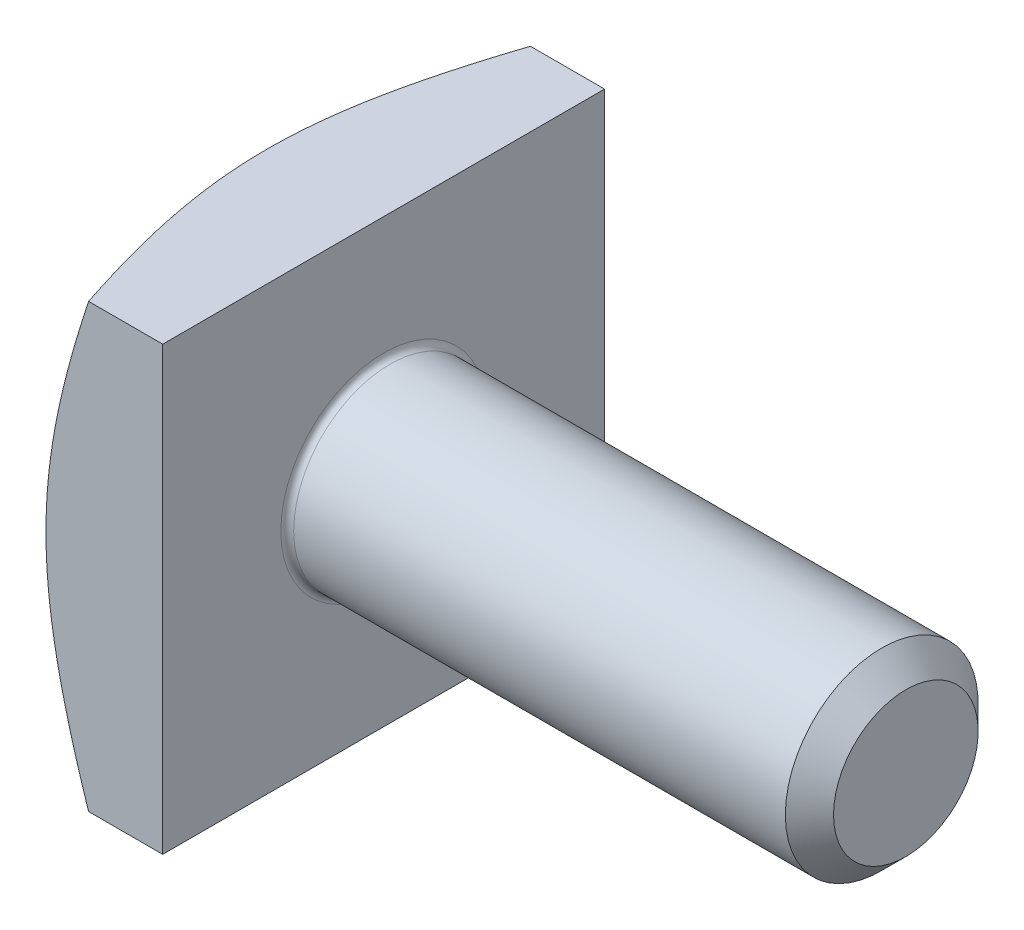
ISO-10303-21;
HEADER;
FILE_DESCRIPTION(('STEP AP214'),'2;1');
FILE_NAME('part.step','',(''),(''),'','','');
FILE_SCHEMA(('AUTOMOTIVE_DESIGN { 1 0 10303 214 1 1 1 1 }'));
ENDSEC;
DATA;
#1=APPLICATION_CONTEXT('core data for automotive mechanical design processes');
#2=APPLICATION_PROTOCOL_DEFINITION('international standard','automotive_design',2000,#1);
#3=PRODUCT_CONTEXT('',#1,'mechanical');
#4=PRODUCT('Part','Part','',(#3));
#5=PRODUCT_RELATED_PRODUCT_CATEGORY('part','',(#4));
#6=PRODUCT_DEFINITION_FORMATION('','',#4);
#7=PRODUCT_DEFINITION_CONTEXT('part definition',#1,'design');
#8=PRODUCT_DEFINITION('design','',#6,#7);
#9=PRODUCT_DEFINITION_SHAPE('','',#8);
#10=(LENGTH_UNIT() NAMED_UNIT(*) SI_UNIT(.MILLI.,.METRE.));
#11=(NAMED_UNIT(*) PLANE_ANGLE_UNIT() SI_UNIT($,.RADIAN.));
#12=(NAMED_UNIT(*) SI_UNIT($,.STERADIAN.) SOLID_ANGLE_UNIT());
#13=UNCERTAINTY_MEASURE_WITH_UNIT(LENGTH_MEASURE(1.E-05),#10,'distance_accuracy_value','');
#14=(GEOMETRIC_REPRESENTATION_CONTEXT(3) GLOBAL_UNCERTAINTY_ASSIGNED_CONTEXT((#13)) GLOBAL_UNIT_ASSIGNED_CONTEXT((#10,
#11,#12)) REPRESENTATION_CONTEXT('',''));
#15=CARTESIAN_POINT('',(0.,0.,0.));
#16=DIRECTION('',(0.,0.,1.));
#17=DIRECTION('',(1.,0.,0.));
#18=AXIS2_PLACEMENT_3D('',#15,#16,#17);
#19=CARTESIAN_POINT('',(15.,-27.5,-27.5));
#20=DIRECTION('',(0.,0.,1.));
#21=DIRECTION('',(1.,0.,0.));
#22=AXIS2_PLACEMENT_3D('',#19,#20,#21);
#23=PLANE('',#22);
#24=CARTESIAN_POINT('',(16.7818884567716,-56.11247290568,-27.5));
#25=CARTESIAN_POINT('',(16.4875123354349,-55.4094358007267,-27.5));
#26=CARTESIAN_POINT('',(16.1940417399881,-54.7060196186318,-27.5));
#27=CARTESIAN_POINT('',(15.6091098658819,-53.2983501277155,-27.5));
#28=CARTESIAN_POINT('',(15.3176485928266,-52.5940968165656,-27.5));
#29=CARTESIAN_POINT('',(14.4465554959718,-50.479912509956,-27.5));
#30=CARTESIAN_POINT('',(13.8702378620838,-49.0686130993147,-27.5));
#31=CARTESIAN_POINT('',(12.7280461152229,-46.2406021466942,-27.5));
#32=CARTESIAN_POINT('',(12.1621798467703,-44.8238874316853,-27.5));
#33=CARTESIAN_POINT('',(11.0439869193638,-41.9851363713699,-27.5));
#34=CARTESIAN_POINT('',(10.4916600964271,-40.5631000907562,-27.5));
#35=CARTESIAN_POINT('',(9.39767023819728,-37.6958260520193,-27.5));
#36=CARTESIAN_POINT('',(8.85620758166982,-36.2505115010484,-27.5));
#37=CARTESIAN_POINT('',(8.06077960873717,-34.0763787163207,-27.5));
#38=CARTESIAN_POINT('',(7.79842639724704,-33.3506269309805,-27.5));
#39=CARTESIAN_POINT('',(7.28009933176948,-31.8968509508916,-27.5));
#40=CARTESIAN_POINT('',(7.02412543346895,-31.1688267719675,-27.5));
#41=CARTESIAN_POINT('',(6.51938357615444,-29.7100887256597,-27.5));
#42=CARTESIAN_POINT('',(6.2706173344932,-28.979374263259,-27.5));
#43=CARTESIAN_POINT('',(5.78139915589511,-27.5151724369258,-27.5));
#44=CARTESIAN_POINT('',(5.54094712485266,-26.7816851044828,-27.5));
#45=CARTESIAN_POINT('',(5.06956848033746,-25.3116698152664,-27.5));
#46=CARTESIAN_POINT('',(4.83864161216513,-24.5751419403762,-27.5));
#47=CARTESIAN_POINT('',(4.38771760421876,-23.0987556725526,-27.5));
#48=CARTESIAN_POINT('',(4.16772034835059,-22.3588973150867,-27.5));
#49=CARTESIAN_POINT('',(3.6278981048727,-20.4857096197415,-27.5));
#50=CARTESIAN_POINT('',(3.31637944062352,-19.3499628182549,-27.5));
#51=CARTESIAN_POINT('',(2.72919809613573,-17.069160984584,-27.5));
#52=CARTESIAN_POINT('',(2.45353545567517,-15.9241059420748,-27.5));
#53=CARTESIAN_POINT('',(1.94617126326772,-13.6250799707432,-27.5));
#54=CARTESIAN_POINT('',(1.71443792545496,-12.4711161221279,-27.5));
#55=CARTESIAN_POINT('',(1.30336658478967,-10.1537245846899,-27.5));
#56=CARTESIAN_POINT('',(1.12402726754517,-8.9902971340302,-27.5));
#57=CARTESIAN_POINT('',(0.900937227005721,-7.24191711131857,-27.5));
#58=CARTESIAN_POINT('',(0.834320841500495,-6.65983257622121,-27.5));
#59=CARTESIAN_POINT('',(0.717025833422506,-5.49404329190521,-27.5));
#60=CARTESIAN_POINT('',(0.666347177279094,-4.91033854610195,-27.5));
#61=CARTESIAN_POINT('',(0.581665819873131,-3.74173957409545,-27.5));
#62=CARTESIAN_POINT('',(0.547662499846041,-3.15684539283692,-27.5));
#63=CARTESIAN_POINT('',(0.496843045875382,-1.98630602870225,-27.5));
#64=CARTESIAN_POINT('',(0.480026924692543,-1.40066084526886,-27.5));
#65=CARTESIAN_POINT('',(0.46385045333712,-0.229448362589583,-27.5));
#66=CARTESIAN_POINT('',(0.464480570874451,0.35611880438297,-27.5));
#67=CARTESIAN_POINT('',(0.483162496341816,1.52696943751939,-27.5));
#68=CARTESIAN_POINT('',(0.501214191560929,2.11225290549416,-27.5));
#69=CARTESIAN_POINT('',(0.554458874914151,3.28204444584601,-27.5));
#70=CARTESIAN_POINT('',(0.589652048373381,3.86655250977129,-27.5));
#71=CARTESIAN_POINT('',(0.676643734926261,5.03433860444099,-27.5));
#72=CARTESIAN_POINT('',(0.728442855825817,5.61761658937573,-27.5));
#73=CARTESIAN_POINT('',(0.887478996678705,7.16820812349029,-27.5));
#74=CARTESIAN_POINT('',(1.00871435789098,8.13410873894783,-27.5));
#75=CARTESIAN_POINT('',(1.29076756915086,10.0601292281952,-27.5));
#76=CARTESIAN_POINT('',(1.45158994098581,11.0202484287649,-27.5));
#77=CARTESIAN_POINT('',(1.80801989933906,12.9345172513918,-27.5));
#78=CARTESIAN_POINT('',(2.00364701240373,13.8886632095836,-27.5));
#79=CARTESIAN_POINT('',(2.42474303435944,15.7902712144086,-27.5));
#80=CARTESIAN_POINT('',(2.65021124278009,16.7377334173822,-27.5));
#81=CARTESIAN_POINT('',(3.12790363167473,18.6318866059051,-27.5));
#82=CARTESIAN_POINT('',(3.38027995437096,19.5785389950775,-27.5));
#83=CARTESIAN_POINT('',(3.90661661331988,21.4657991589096,-27.5));
#84=CARTESIAN_POINT('',(4.18057705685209,22.4064069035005,-27.5));
#85=CARTESIAN_POINT('',(4.74654571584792,24.2818854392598,-27.5));
#86=CARTESIAN_POINT('',(5.03854916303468,25.2167576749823,-27.5));
#87=CARTESIAN_POINT('',(5.63776942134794,27.0815948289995,-27.5));
#88=CARTESIAN_POINT('',(5.94498618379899,28.0115597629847,-27.5));
#89=CARTESIAN_POINT('',(6.58605555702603,29.9080557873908,-27.5));
#90=CARTESIAN_POINT('',(6.92048533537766,30.8743913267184,-27.5));
#91=CARTESIAN_POINT('',(7.6010570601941,32.8029211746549,-27.5));
#92=CARTESIAN_POINT('',(7.94719902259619,33.7651154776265,-27.5));
#93=CARTESIAN_POINT('',(8.64938197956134,35.6859523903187,-27.5));
#94=CARTESIAN_POINT('',(9.0054236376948,36.6445947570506,-27.5));
#95=CARTESIAN_POINT('',(9.72588198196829,38.5587283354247,-27.5));
#96=CARTESIAN_POINT('',(10.0902987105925,39.5142195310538,-27.5));
#97=CARTESIAN_POINT('',(10.8209962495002,41.4087682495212,-27.5));
#98=CARTESIAN_POINT('',(11.1871754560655,42.3478650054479,-27.5));
#99=CARTESIAN_POINT('',(11.9254972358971,44.2237123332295,-27.5));
#100=CARTESIAN_POINT('',(12.2976398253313,45.1604628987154,-27.5));
#101=CARTESIAN_POINT('',(13.0469757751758,47.0316639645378,-27.5));
#102=CARTESIAN_POINT('',(13.4241678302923,47.9661149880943,-27.5));
#103=CARTESIAN_POINT('',(14.1830373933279,49.8331810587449,-27.5));
#104=CARTESIAN_POINT('',(14.5647148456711,50.7657961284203,-27.5));
#105=CARTESIAN_POINT('',(14.9483107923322,51.6976176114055,-27.5));
#106=B_SPLINE_CURVE_WITH_KNOTS('',3,(#24,#25,#26,#27,#28,#29,#30,#31,#32,#33,#34,#35,#36,#37,
#38,#39,#40,#41,#42,#43,#44,#45,#46,#47,#48,#49,#50,#51,#52,#53,#54,#55,#56,#57,#58,#59,#60,#61,
#62,#63,#64,#65,#66,#67,#68,#69,#70,#71,#72,#73,#74,#75,#76,#77,#78,#79,#80,#81,#82,#83,#84,#85,
#86,#87,#88,#89,#90,#91,#92,#93,#94,#95,#96,#97,#98,#99,#100,#101,#102,#103,#104,#105),
.UNSPECIFIED.,.F.,.F.,(4,2,2,2,2,2,2,2,2,2,2,2,2,2,2,2,2,2,2,2,2,2,2,2,2,2,2,2,2,2,2,2,2,2,2,2,
2,2,2,2,4),(0.,2.28653910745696,4.57308458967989,9.14635759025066,13.7229340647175,
18.2994550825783,22.929522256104,25.2446449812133,27.5597516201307,29.8754054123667,
32.1910329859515,34.5065986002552,36.8221396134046,40.3547352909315,43.8873348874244,
47.4173685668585,50.9473136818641,52.7047830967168,54.4622488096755,56.2196493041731,
57.9770511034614,59.7334927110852,61.4899229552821,63.2463721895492,65.0028857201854,
67.9223306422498,70.842109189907,73.7635310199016,76.6848842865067,79.6237320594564,
82.5625944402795,85.5006834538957,88.4387630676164,91.5063805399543,94.574002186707,
97.6418299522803,100.709673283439,103.733539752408,106.757414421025,109.780521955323,
112.803592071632),.UNSPECIFIED.);
#107=CARTESIAN_POINT('',(5.77795895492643,27.5,-27.5));
#108=VERTEX_POINT('',#107);
#109=CARTESIAN_POINT('',(5.77795895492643,-27.5,-27.5));
#110=VERTEX_POINT('',#109);
#111=EDGE_CURVE('E51',#108,#110,#106,.F.);
#112=ORIENTED_EDGE('',*,*,#111,.F.);
#113=DIRECTION('',(-1.,0.,0.));
#114=VECTOR('',#113,1.);
#115=CARTESIAN_POINT('',(15.,27.5,-27.5));
#116=LINE('',#115,#114);
#117=CARTESIAN_POINT('',(15.,27.5,-27.5));
#118=VERTEX_POINT('',#117);
#119=EDGE_CURVE('E98',#118,#108,#116,.T.);
#120=ORIENTED_EDGE('',*,*,#119,.F.);
#121=DIRECTION('',(0.,1.,0.));
#122=VECTOR('',#121,1.);
#123=CARTESIAN_POINT('',(15.,-27.5,-27.5));
#124=LINE('',#123,#122);
#125=CARTESIAN_POINT('',(15.,-27.5,-27.5));
#126=VERTEX_POINT('',#125);
#127=EDGE_CURVE('E184',#126,#118,#124,.T.);
#128=ORIENTED_EDGE('',*,*,#127,.F.);
#129=DIRECTION('',(-1.,0.,0.));
#130=VECTOR('',#129,1.);
#131=CARTESIAN_POINT('',(15.,-27.5,-27.5));
#132=LINE('',#131,#130);
#133=EDGE_CURVE('E96',#126,#110,#132,.T.);
#134=ORIENTED_EDGE('',*,*,#133,.T.);
#135=EDGE_LOOP('',(#112,#120,#128,#134));
#136=FACE_BOUND('',#135,.T.);
#137=ADVANCED_FACE('F36',(#136),#23,.F.);
#138=CARTESIAN_POINT('',(15.,27.5,-27.5));
#139=DIRECTION('',(0.,-1.,0.));
#140=DIRECTION('',(0.,0.,-1.));
#141=AXIS2_PLACEMENT_3D('',#138,#139,#140);
#142=PLANE('',#141);
#143=CARTESIAN_POINT('',(16.7818884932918,27.5,-56.1124729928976));
#144=CARTESIAN_POINT('',(16.4875123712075,27.5,-55.4094358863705));
#145=CARTESIAN_POINT('',(16.1940417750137,27.5,-54.7060197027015));
#146=CARTESIAN_POINT('',(15.609109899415,27.5,-53.2983502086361));
#147=CARTESIAN_POINT('',(15.3176486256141,27.5,-52.5940968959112));
#148=CARTESIAN_POINT('',(14.4465555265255,27.5,-50.4799125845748));
#149=CARTESIAN_POINT('',(13.870237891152,27.5,-49.06861317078));
#150=CARTESIAN_POINT('',(12.7280461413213,27.5,-46.2406022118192));
#151=CARTESIAN_POINT('',(12.1621798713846,27.5,-44.8238874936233));
#152=CARTESIAN_POINT('',(11.0439869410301,27.5,-41.9851364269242));
#153=CARTESIAN_POINT('',(10.4916601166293,27.5,-40.5631001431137));
#154=CARTESIAN_POINT('',(9.39767025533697,27.5,-37.6958260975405));
#155=CARTESIAN_POINT('',(8.85620759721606,27.5,-36.2505115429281));
#156=CARTESIAN_POINT('',(8.06077962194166,27.5,-34.0763787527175));
#157=CARTESIAN_POINT('',(7.79842640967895,27.5,-33.350626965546));
#158=CARTESIAN_POINT('',(7.28009934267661,27.5,-31.8968509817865));
#159=CARTESIAN_POINT('',(7.02412544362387,27.5,-31.1688268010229));
#160=CARTESIAN_POINT('',(6.51938358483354,27.5,-29.7100887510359));
#161=CARTESIAN_POINT('',(6.2706173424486,27.5,-28.9793742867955));
#162=CARTESIAN_POINT('',(5.78139916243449,27.5,-27.5151724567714));
#163=CARTESIAN_POINT('',(5.54094713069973,27.5,-26.7816851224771));
#164=CARTESIAN_POINT('',(5.06956848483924,27.5,-25.3116698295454));
#165=CARTESIAN_POINT('',(4.83864161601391,27.5,-24.5751419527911));
#166=CARTESIAN_POINT('',(4.38771760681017,27.5,-23.0987556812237));
#167=CARTESIAN_POINT('',(4.16772035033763,27.5,-22.358897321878));
#168=CARTESIAN_POINT('',(3.62789810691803,27.5,-20.4857096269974));
#169=CARTESIAN_POINT('',(3.31637944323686,27.5,-19.3499628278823));
#170=CARTESIAN_POINT('',(2.72919809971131,27.5,-17.069160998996));
#171=CARTESIAN_POINT('',(2.45353545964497,27.5,-15.9241059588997));
#172=CARTESIAN_POINT('',(1.94617126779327,27.5,-13.6250799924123));
#173=CARTESIAN_POINT('',(1.71443793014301,27.5,-12.471116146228));
#174=CARTESIAN_POINT('',(1.30336658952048,27.5,-10.1537246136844));
#175=CARTESIAN_POINT('',(1.12402727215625,27.5,-8.99029716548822));
#176=CARTESIAN_POINT('',(0.900937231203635,27.5,-7.2419171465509));
#177=CARTESIAN_POINT('',(0.834320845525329,27.5,-6.65983261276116));
#178=CARTESIAN_POINT('',(0.717025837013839,27.5,-5.49404333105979));
#179=CARTESIAN_POINT('',(0.666347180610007,27.5,-4.91033858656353));
#180=CARTESIAN_POINT('',(0.581665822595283,27.5,-3.74173961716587));
#181=CARTESIAN_POINT('',(0.547662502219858,27.5,-3.15684543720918));
#182=CARTESIAN_POINT('',(0.496843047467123,27.5,-1.98630607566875));
#183=CARTESIAN_POINT('',(0.480026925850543,27.5,-1.40066089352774));
#184=CARTESIAN_POINT('',(0.463850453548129,27.5,-0.229448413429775));
#185=CARTESIAN_POINT('',(0.46448057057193,27.5,0.356118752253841));
#186=CARTESIAN_POINT('',(0.48316249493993,27.5,1.52696938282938));
#187=CARTESIAN_POINT('',(0.501214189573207,27.5,2.11225284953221));
#188=CARTESIAN_POINT('',(0.554458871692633,27.5,3.28204438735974));
#189=CARTESIAN_POINT('',(0.58965204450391,27.5,3.86655245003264));
#190=CARTESIAN_POINT('',(0.676643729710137,27.5,5.03433854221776));
#191=CARTESIAN_POINT('',(0.728442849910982,27.5,5.61761652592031));
#192=CARTESIAN_POINT('',(0.887478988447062,27.5,7.16820805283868));
#193=CARTESIAN_POINT('',(1.00871434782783,27.5,8.13410866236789));
#194=CARTESIAN_POINT('',(1.29076755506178,27.5,10.0601291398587));
#195=CARTESIAN_POINT('',(1.45158992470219,27.5,11.0202483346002));
#196=CARTESIAN_POINT('',(1.80801987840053,27.5,12.9345171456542));
#197=CARTESIAN_POINT('',(2.00364698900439,27.5,13.8886630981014));
#198=CARTESIAN_POINT('',(2.42474300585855,27.5,15.7902710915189));
#199=CARTESIAN_POINT('',(2.6502112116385,27.5,16.7377332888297));
#200=CARTESIAN_POINT('',(3.1279035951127,27.5,18.6318864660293));
#201=CARTESIAN_POINT('',(3.38027991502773,27.5,19.5785388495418));
#202=CARTESIAN_POINT('',(3.90661656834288,27.5,21.4657990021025));
#203=CARTESIAN_POINT('',(4.1805770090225,27.5,22.406406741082));
#204=CARTESIAN_POINT('',(4.74654566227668,27.5,24.28188526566));
#205=CARTESIAN_POINT('',(5.03854910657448,27.5,25.2167574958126));
#206=CARTESIAN_POINT('',(5.63776935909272,27.5,27.0815946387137));
#207=CARTESIAN_POINT('',(5.94498611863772,27.5,28.0115595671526));
#208=CARTESIAN_POINT('',(6.5860554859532,27.5,29.9080555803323));
#209=CARTESIAN_POINT('',(6.92048526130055,27.5,30.87439111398));
#210=CARTESIAN_POINT('',(7.60105698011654,27.5,32.8029209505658));
#211=CARTESIAN_POINT('',(7.94719893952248,27.5,33.7651152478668));
#212=CARTESIAN_POINT('',(8.64938189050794,27.5,35.6859521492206));
#213=CARTESIAN_POINT('',(9.00542354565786,27.5,36.6445945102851));
#214=CARTESIAN_POINT('',(9.72588188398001,27.5,38.5587280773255));
#215=CARTESIAN_POINT('',(10.0902986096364,27.5,39.5142192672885));
#216=CARTESIAN_POINT('',(10.8209961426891,27.5,41.4087679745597));
#217=CARTESIAN_POINT('',(11.1871753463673,27.5,42.3478647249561));
#218=CARTESIAN_POINT('',(11.9254971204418,27.5,44.2237120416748));
#219=CARTESIAN_POINT('',(12.2976397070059,27.5,45.1604626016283));
#220=CARTESIAN_POINT('',(13.0469756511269,27.5,47.0316636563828));
#221=CARTESIAN_POINT('',(13.42416770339,27.5,47.966114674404));
#222=CARTESIAN_POINT('',(14.1830372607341,27.5,49.8331807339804));
#223=CARTESIAN_POINT('',(14.5647147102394,27.5,50.7657957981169));
#224=CARTESIAN_POINT('',(14.9483106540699,27.5,51.6976172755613));
#225=B_SPLINE_CURVE_WITH_KNOTS('',3,(#143,#144,#145,#146,#147,#148,#149,#150,#151,#152,#153,
#154,#155,#156,#157,#158,#159,#160,#161,#162,#163,#164,#165,#166,#167,#168,#169,#170,#171,#172,
#173,#174,#175,#176,#177,#178,#179,#180,#181,#182,#183,#184,#185,#186,#187,#188,#189,#190,#191,
#192,#193,#194,#195,#196,#197,#198,#199,#200,#201,#202,#203,#204,#205,#206,#207,#208,#209,#210,
#211,#212,#213,#214,#215,#216,#217,#218,#219,#220,#221,#222,#223,#224),.UNSPECIFIED.,.F.,.F.,(4,
2,2,2,2,2,2,2,2,2,2,2,2,2,2,2,2,2,2,2,2,2,2,2,2,2,2,2,2,2,2,2,2,2,2,2,2,2,2,2,4),(0.,
2.28653911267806,4.57308460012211,9.14635761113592,13.7229340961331,18.2994551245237,
22.9295223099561,25.2446450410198,27.5597516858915,29.8754054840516,32.1910330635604,
34.506598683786,36.8221397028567,40.354735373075,43.887334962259,47.4173686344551,
50.9473137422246,52.7047831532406,54.4622488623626,56.2196493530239,57.9770511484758,
59.7334927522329,61.489922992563,63.2463722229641,65.0028857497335,67.9223306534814,
70.8421091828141,73.7635309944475,76.6848842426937,79.623731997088,82.5625943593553,
85.5006833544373,88.438762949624,91.5063804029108,94.5740020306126,97.6418297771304,
100.709673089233,103.733539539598,106.757414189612,109.780521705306,112.803591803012),.UNSPECIFIED.);
#226=CARTESIAN_POINT('',(5.77795895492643,27.5,27.5));
#227=VERTEX_POINT('',#226);
#228=EDGE_CURVE('E93',#227,#108,#225,.F.);
#229=ORIENTED_EDGE('',*,*,#228,.F.);
#230=DIRECTION('',(-1.,0.,0.));
#231=VECTOR('',#230,1.);
#232=CARTESIAN_POINT('',(15.,27.5,27.5));
#233=LINE('',#232,#231);
#234=CARTESIAN_POINT('',(15.,27.5,27.5));
#235=VERTEX_POINT('',#234);
#236=EDGE_CURVE('E92',#235,#227,#233,.T.);
#237=ORIENTED_EDGE('',*,*,#236,.F.);
#238=DIRECTION('',(0.,0.,1.));
#239=VECTOR('',#238,1.);
#240=CARTESIAN_POINT('',(15.,27.5,-27.5));
#241=LINE('',#240,#239);
#242=EDGE_CURVE('E185',#118,#235,#241,.T.);
#243=ORIENTED_EDGE('',*,*,#242,.F.);
#244=ORIENTED_EDGE('',*,*,#119,.T.);
#245=EDGE_LOOP('',(#229,#237,#243,#244));
#246=FACE_BOUND('',#245,.T.);
#247=ADVANCED_FACE('F120',(#246),#142,.F.);
#248=CARTESIAN_POINT('',(15.,27.5,27.5));
#249=DIRECTION('',(0.,0.,-1.));
#250=DIRECTION('',(0.,1.,0.));
#251=AXIS2_PLACEMENT_3D('',#248,#249,#250);
#252=PLANE('',#251);
#253=CARTESIAN_POINT('',(16.7818884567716,-56.11247290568,27.5));
#254=CARTESIAN_POINT('',(16.4875123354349,-55.4094358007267,27.5));
#255=CARTESIAN_POINT('',(16.1940417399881,-54.7060196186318,27.5));
#256=CARTESIAN_POINT('',(15.6091098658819,-53.2983501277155,27.5));
#257=CARTESIAN_POINT('',(15.3176485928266,-52.5940968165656,27.5));
#258=CARTESIAN_POINT('',(14.4465554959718,-50.479912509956,27.5));
#259=CARTESIAN_POINT('',(13.8702378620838,-49.0686130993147,27.5));
#260=CARTESIAN_POINT('',(12.7280461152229,-46.2406021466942,27.5));
#261=CARTESIAN_POINT('',(12.1621798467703,-44.8238874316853,27.5));
#262=CARTESIAN_POINT('',(11.0439869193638,-41.9851363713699,27.5));
#263=CARTESIAN_POINT('',(10.4916600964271,-40.5631000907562,27.5));
#264=CARTESIAN_POINT('',(9.39767023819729,-37.6958260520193,27.5));
#265=CARTESIAN_POINT('',(8.85620758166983,-36.2505115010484,27.5));
#266=CARTESIAN_POINT('',(8.06077960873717,-34.0763787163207,27.5));
#267=CARTESIAN_POINT('',(7.79842639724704,-33.3506269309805,27.5));
#268=CARTESIAN_POINT('',(7.28009933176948,-31.8968509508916,27.5));
#269=CARTESIAN_POINT('',(7.02412543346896,-31.1688267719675,27.5));
#270=CARTESIAN_POINT('',(6.51938357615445,-29.7100887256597,27.5));
#271=CARTESIAN_POINT('',(6.27061733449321,-28.979374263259,27.5));
#272=CARTESIAN_POINT('',(5.78139915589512,-27.5151724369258,27.5));
#273=CARTESIAN_POINT('',(5.54094712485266,-26.7816851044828,27.5));
#274=CARTESIAN_POINT('',(5.06956848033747,-25.3116698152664,27.5));
#275=CARTESIAN_POINT('',(4.83864161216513,-24.5751419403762,27.5));
#276=CARTESIAN_POINT('',(4.38771760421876,-23.0987556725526,27.5));
#277=CARTESIAN_POINT('',(4.16772034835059,-22.3588973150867,27.5));
#278=CARTESIAN_POINT('',(3.6278981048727,-20.4857096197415,27.5));
#279=CARTESIAN_POINT('',(3.31637944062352,-19.3499628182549,27.5));
#280=CARTESIAN_POINT('',(2.72919809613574,-17.069160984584,27.5));
#281=CARTESIAN_POINT('',(2.45353545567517,-15.9241059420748,27.5));
#282=CARTESIAN_POINT('',(1.94617126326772,-13.6250799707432,27.5));
#283=CARTESIAN_POINT('',(1.71443792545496,-12.4711161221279,27.5));
#284=CARTESIAN_POINT('',(1.30336658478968,-10.1537245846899,27.5));
#285=CARTESIAN_POINT('',(1.12402726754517,-8.9902971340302,27.5));
#286=CARTESIAN_POINT('',(0.900937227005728,-7.24191711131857,27.5));
#287=CARTESIAN_POINT('',(0.834320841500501,-6.65983257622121,27.5));
#288=CARTESIAN_POINT('',(0.717025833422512,-5.49404329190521,27.5));
#289=CARTESIAN_POINT('',(0.666347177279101,-4.91033854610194,27.5));
#290=CARTESIAN_POINT('',(0.581665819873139,-3.74173957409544,27.5));
#291=CARTESIAN_POINT('',(0.547662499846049,-3.15684539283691,27.5));
#292=CARTESIAN_POINT('',(0.49684304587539,-1.98630602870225,27.5));
#293=CARTESIAN_POINT('',(0.480026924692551,-1.40066084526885,27.5));
#294=CARTESIAN_POINT('',(0.463850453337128,-0.229448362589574,27.5));
#295=CARTESIAN_POINT('',(0.464480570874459,0.356118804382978,27.5));
#296=CARTESIAN_POINT('',(0.483162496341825,1.5269694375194,27.5));
#297=CARTESIAN_POINT('',(0.501214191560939,2.11225290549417,27.5));
#298=CARTESIAN_POINT('',(0.55445887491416,3.28204444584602,27.5));
#299=CARTESIAN_POINT('',(0.589652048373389,3.8665525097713,27.5));
#300=CARTESIAN_POINT('',(0.676643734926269,5.034338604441,27.5));
#301=CARTESIAN_POINT('',(0.728442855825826,5.61761658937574,27.5));
#302=CARTESIAN_POINT('',(0.887478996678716,7.1682081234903,27.5));
#303=CARTESIAN_POINT('',(1.00871435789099,8.13410873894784,27.5));
#304=CARTESIAN_POINT('',(1.29076756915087,10.0601292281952,27.5));
#305=CARTESIAN_POINT('',(1.45158994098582,11.0202484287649,27.5));
#306=CARTESIAN_POINT('',(1.80801989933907,12.9345172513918,27.5));
#307=CARTESIAN_POINT('',(2.00364701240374,13.8886632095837,27.5));
#308=CARTESIAN_POINT('',(2.42474303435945,15.7902712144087,27.5));
#309=CARTESIAN_POINT('',(2.6502112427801,16.7377334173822,27.5));
#310=CARTESIAN_POINT('',(3.12790363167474,18.6318866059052,27.5));
#311=CARTESIAN_POINT('',(3.38027995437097,19.5785389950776,27.5));
#312=CARTESIAN_POINT('',(3.90661661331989,21.4657991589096,27.5));
#313=CARTESIAN_POINT('',(4.18057705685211,22.4064069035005,27.5));
#314=CARTESIAN_POINT('',(4.74654571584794,24.2818854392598,27.5));
#315=CARTESIAN_POINT('',(5.0385491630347,25.2167576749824,27.5));
#316=CARTESIAN_POINT('',(5.63776942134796,27.0815948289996,27.5));
#317=CARTESIAN_POINT('',(5.94498618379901,28.0115597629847,27.5));
#318=CARTESIAN_POINT('',(6.58605555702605,29.9080557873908,27.5));
#319=CARTESIAN_POINT('',(6.92048533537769,30.8743913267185,27.5));
#320=CARTESIAN_POINT('',(7.60105706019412,32.8029211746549,27.5));
#321=CARTESIAN_POINT('',(7.94719902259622,33.7651154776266,27.5));
#322=CARTESIAN_POINT('',(8.64938197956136,35.6859523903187,27.5));
#323=CARTESIAN_POINT('',(9.00542363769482,36.6445947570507,27.5));
#324=CARTESIAN_POINT('',(9.72588198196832,38.5587283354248,27.5));
#325=CARTESIAN_POINT('',(10.0902987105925,39.5142195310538,27.5));
#326=CARTESIAN_POINT('',(10.8209962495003,41.4087682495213,27.5));
#327=CARTESIAN_POINT('',(11.1871754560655,42.347865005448,27.5));
#328=CARTESIAN_POINT('',(11.9254972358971,44.2237123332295,27.5));
#329=CARTESIAN_POINT('',(12.2976398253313,45.1604628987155,27.5));
#330=CARTESIAN_POINT('',(13.0469757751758,47.0316639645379,27.5));
#331=CARTESIAN_POINT('',(13.4241678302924,47.9661149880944,27.5));
#332=CARTESIAN_POINT('',(14.1830373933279,49.833181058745,27.5));
#333=CARTESIAN_POINT('',(14.5647148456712,50.7657961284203,27.5));
#334=CARTESIAN_POINT('',(14.9483107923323,51.6976176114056,27.5));
#335=B_SPLINE_CURVE_WITH_KNOTS('',3,(#253,#254,#255,#256,#257,#258,#259,#260,#261,#262,#263,
#264,#265,#266,#267,#268,#269,#270,#271,#272,#273,#274,#275,#276,#277,#278,#279,#280,#281,#282,
#283,#284,#285,#286,#287,#288,#289,#290,#291,#292,#293,#294,#295,#296,#297,#298,#299,#300,#301,
#302,#303,#304,#305,#306,#307,#308,#309,#310,#311,#312,#313,#314,#315,#316,#317,#318,#319,#320,
#321,#322,#323,#324,#325,#326,#327,#328,#329,#330,#331,#332,#333,#334),.UNSPECIFIED.,.F.,.F.,(4,
2,2,2,2,2,2,2,2,2,2,2,2,2,2,2,2,2,2,2,2,2,2,2,2,2,2,2,2,2,2,2,2,2,2,2,2,2,2,2,4),(0.,
2.28653910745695,4.57308458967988,9.14635759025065,13.7229340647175,18.2994550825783,
22.929522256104,25.2446449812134,27.5597516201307,29.8754054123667,32.1910329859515,
34.5065986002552,36.8221396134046,40.3547352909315,43.8873348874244,47.4173685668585,
50.9473136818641,52.7047830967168,54.4622488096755,56.2196493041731,57.9770511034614,
59.7334927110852,61.4899229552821,63.2463721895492,65.0028857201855,67.9223306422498,
70.8421091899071,73.7635310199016,76.6848842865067,79.6237320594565,82.5625944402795,
85.5006834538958,88.4387630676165,91.5063805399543,94.574002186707,97.6418299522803,
100.709673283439,103.733539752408,106.757414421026,109.780521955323,112.803592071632),.UNSPECIFIED.);
#336=CARTESIAN_POINT('',(5.77795895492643,-27.5,27.5));
#337=VERTEX_POINT('',#336);
#338=EDGE_CURVE('E78',#337,#227,#335,.T.);
#339=ORIENTED_EDGE('',*,*,#338,.F.);
#340=DIRECTION('',(-1.,0.,0.));
#341=VECTOR('',#340,1.);
#342=CARTESIAN_POINT('',(15.,-27.5,27.5));
#343=LINE('',#342,#341);
#344=CARTESIAN_POINT('',(15.,-27.5,27.5));
#345=VERTEX_POINT('',#344);
#346=EDGE_CURVE('E90',#345,#337,#343,.T.);
#347=ORIENTED_EDGE('',*,*,#346,.F.);
#348=DIRECTION('',(0.,-1.,0.));
#349=VECTOR('',#348,1.);
#350=CARTESIAN_POINT('',(15.,27.5,27.5));
#351=LINE('',#350,#349);
#352=EDGE_CURVE('E189',#235,#345,#351,.T.);
#353=ORIENTED_EDGE('',*,*,#352,.F.);
#354=ORIENTED_EDGE('',*,*,#236,.T.);
#355=EDGE_LOOP('',(#339,#347,#353,#354));
#356=FACE_BOUND('',#355,.T.);
#357=ADVANCED_FACE('F88',(#356),#252,.F.);
#358=CARTESIAN_POINT('',(15.,-27.5,27.5));
#359=DIRECTION('',(0.,1.,0.));
#360=DIRECTION('',(0.,0.,1.));
#361=AXIS2_PLACEMENT_3D('',#358,#359,#360);
#362=PLANE('',#361);
#363=CARTESIAN_POINT('',(16.7818884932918,-27.5,-56.1124729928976));
#364=CARTESIAN_POINT('',(16.4875123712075,-27.5,-55.4094358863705));
#365=CARTESIAN_POINT('',(16.1940417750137,-27.5,-54.7060197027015));
#366=CARTESIAN_POINT('',(15.609109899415,-27.5,-53.2983502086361));
#367=CARTESIAN_POINT('',(15.3176486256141,-27.5,-52.5940968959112));
#368=CARTESIAN_POINT('',(14.4465555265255,-27.5,-50.4799125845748));
#369=CARTESIAN_POINT('',(13.870237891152,-27.5,-49.06861317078));
#370=CARTESIAN_POINT('',(12.7280461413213,-27.5,-46.2406022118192));
#371=CARTESIAN_POINT('',(12.1621798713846,-27.5,-44.8238874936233));
#372=CARTESIAN_POINT('',(11.0439869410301,-27.5,-41.9851364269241));
#373=CARTESIAN_POINT('',(10.4916601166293,-27.5,-40.5631001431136));
#374=CARTESIAN_POINT('',(9.39767025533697,-27.5,-37.6958260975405));
#375=CARTESIAN_POINT('',(8.85620759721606,-27.5,-36.2505115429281));
#376=CARTESIAN_POINT('',(8.06077962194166,-27.5,-34.0763787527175));
#377=CARTESIAN_POINT('',(7.79842640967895,-27.5,-33.350626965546));
#378=CARTESIAN_POINT('',(7.28009934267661,-27.5,-31.8968509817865));
#379=CARTESIAN_POINT('',(7.02412544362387,-27.5,-31.1688268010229));
#380=CARTESIAN_POINT('',(6.51938358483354,-27.5,-29.7100887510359));
#381=CARTESIAN_POINT('',(6.2706173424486,-27.5,-28.9793742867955));
#382=CARTESIAN_POINT('',(5.78139916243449,-27.5,-27.5151724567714));
#383=CARTESIAN_POINT('',(5.54094713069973,-27.5,-26.7816851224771));
#384=CARTESIAN_POINT('',(5.06956848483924,-27.5,-25.3116698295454));
#385=CARTESIAN_POINT('',(4.83864161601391,-27.5,-24.5751419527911));
#386=CARTESIAN_POINT('',(4.38771760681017,-27.5,-23.0987556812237));
#387=CARTESIAN_POINT('',(4.16772035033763,-27.5,-22.358897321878));
#388=CARTESIAN_POINT('',(3.62789810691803,-27.5,-20.4857096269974));
#389=CARTESIAN_POINT('',(3.31637944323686,-27.5,-19.3499628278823));
#390=CARTESIAN_POINT('',(2.72919809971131,-27.5,-17.069160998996));
#391=CARTESIAN_POINT('',(2.45353545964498,-27.5,-15.9241059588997));
#392=CARTESIAN_POINT('',(1.94617126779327,-27.5,-13.6250799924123));
#393=CARTESIAN_POINT('',(1.71443793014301,-27.5,-12.471116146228));
#394=CARTESIAN_POINT('',(1.30336658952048,-27.5,-10.1537246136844));
#395=CARTESIAN_POINT('',(1.12402727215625,-27.5,-8.99029716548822));
#396=CARTESIAN_POINT('',(0.900937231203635,-27.5,-7.2419171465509));
#397=CARTESIAN_POINT('',(0.834320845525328,-27.5,-6.65983261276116));
#398=CARTESIAN_POINT('',(0.717025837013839,-27.5,-5.49404333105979));
#399=CARTESIAN_POINT('',(0.666347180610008,-27.5,-4.91033858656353));
#400=CARTESIAN_POINT('',(0.581665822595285,-27.5,-3.74173961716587));
#401=CARTESIAN_POINT('',(0.547662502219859,-27.5,-3.15684543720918));
#402=CARTESIAN_POINT('',(0.496843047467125,-27.5,-1.98630607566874));
#403=CARTESIAN_POINT('',(0.480026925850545,-27.5,-1.40066089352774));
#404=CARTESIAN_POINT('',(0.463850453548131,-27.5,-0.229448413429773));
#405=CARTESIAN_POINT('',(0.464480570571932,-27.5,0.356118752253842));
#406=CARTESIAN_POINT('',(0.483162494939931,-27.5,1.52696938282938));
#407=CARTESIAN_POINT('',(0.501214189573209,-27.5,2.11225284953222));
#408=CARTESIAN_POINT('',(0.554458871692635,-27.5,3.28204438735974));
#409=CARTESIAN_POINT('',(0.589652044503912,-27.5,3.86655245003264));
#410=CARTESIAN_POINT('',(0.676643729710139,-27.5,5.03433854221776));
#411=CARTESIAN_POINT('',(0.728442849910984,-27.5,5.61761652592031));
#412=CARTESIAN_POINT('',(0.887478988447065,-27.5,7.16820805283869));
#413=CARTESIAN_POINT('',(1.00871434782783,-27.5,8.13410866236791));
#414=CARTESIAN_POINT('',(1.29076755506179,-27.5,10.0601291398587));
#415=CARTESIAN_POINT('',(1.45158992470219,-27.5,11.0202483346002));
#416=CARTESIAN_POINT('',(1.80801987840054,-27.5,12.9345171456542));
#417=CARTESIAN_POINT('',(2.00364698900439,-27.5,13.8886630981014));
#418=CARTESIAN_POINT('',(2.42474300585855,-27.5,15.7902710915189));
#419=CARTESIAN_POINT('',(2.6502112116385,-27.5,16.7377332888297));
#420=CARTESIAN_POINT('',(3.1279035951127,-27.5,18.6318864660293));
#421=CARTESIAN_POINT('',(3.38027991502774,-27.5,19.5785388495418));
#422=CARTESIAN_POINT('',(3.90661656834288,-27.5,21.4657990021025));
#423=CARTESIAN_POINT('',(4.18057700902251,-27.5,22.406406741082));
#424=CARTESIAN_POINT('',(4.74654566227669,-27.5,24.28188526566));
#425=CARTESIAN_POINT('',(5.03854910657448,-27.5,25.2167574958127));
#426=CARTESIAN_POINT('',(5.63776935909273,-27.5,27.0815946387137));
#427=CARTESIAN_POINT('',(5.94498611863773,-27.5,28.0115595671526));
#428=CARTESIAN_POINT('',(6.58605548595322,-27.5,29.9080555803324));
#429=CARTESIAN_POINT('',(6.92048526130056,-27.5,30.87439111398));
#430=CARTESIAN_POINT('',(7.60105698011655,-27.5,32.8029209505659));
#431=CARTESIAN_POINT('',(7.9471989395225,-27.5,33.7651152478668));
#432=CARTESIAN_POINT('',(8.64938189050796,-27.5,35.6859521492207));
#433=CARTESIAN_POINT('',(9.00542354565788,-27.5,36.6445945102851));
#434=CARTESIAN_POINT('',(9.72588188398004,-27.5,38.5587280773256));
#435=CARTESIAN_POINT('',(10.0902986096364,-27.5,39.5142192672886));
#436=CARTESIAN_POINT('',(10.8209961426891,-27.5,41.4087679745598));
#437=CARTESIAN_POINT('',(11.1871753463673,-27.5,42.3478647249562));
#438=CARTESIAN_POINT('',(11.9254971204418,-27.5,44.2237120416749));
#439=CARTESIAN_POINT('',(12.2976397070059,-27.5,45.1604626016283));
#440=CARTESIAN_POINT('',(13.0469756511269,-27.5,47.0316636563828));
#441=CARTESIAN_POINT('',(13.42416770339,-27.5,47.966114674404));
#442=CARTESIAN_POINT('',(14.1830372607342,-27.5,49.8331807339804));
#443=CARTESIAN_POINT('',(14.5647147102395,-27.5,50.7657957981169));
#444=CARTESIAN_POINT('',(14.9483106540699,-27.5,51.6976172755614));
#445=B_SPLINE_CURVE_WITH_KNOTS('',3,(#363,#364,#365,#366,#367,#368,#369,#370,#371,#372,#373,
#374,#375,#376,#377,#378,#379,#380,#381,#382,#383,#384,#385,#386,#387,#388,#389,#390,#391,#392,
#393,#394,#395,#396,#397,#398,#399,#400,#401,#402,#403,#404,#405,#406,#407,#408,#409,#410,#411,
#412,#413,#414,#415,#416,#417,#418,#419,#420,#421,#422,#423,#424,#425,#426,#427,#428,#429,#430,
#431,#432,#433,#434,#435,#436,#437,#438,#439,#440,#441,#442,#443,#444),.UNSPECIFIED.,.F.,.F.,(4,
2,2,2,2,2,2,2,2,2,2,2,2,2,2,2,2,2,2,2,2,2,2,2,2,2,2,2,2,2,2,2,2,2,2,2,2,2,2,2,4),(0.,
2.28653911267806,4.57308460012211,9.14635761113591,13.7229340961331,18.2994551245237,
22.9295223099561,25.2446450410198,27.5597516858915,29.8754054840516,32.1910330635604,
34.506598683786,36.8221397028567,40.354735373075,43.887334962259,47.4173686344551,
50.9473137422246,52.7047831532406,54.4622488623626,56.2196493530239,57.9770511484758,
59.7334927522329,61.4899229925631,63.2463722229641,65.0028857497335,67.9223306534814,
70.8421091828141,73.7635309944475,76.6848842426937,79.623731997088,82.5625943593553,
85.5006833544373,88.438762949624,91.5063804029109,94.5740020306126,97.6418297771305,
100.709673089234,103.733539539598,106.757414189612,109.780521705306,112.803591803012),.UNSPECIFIED.);
#446=EDGE_CURVE('E75',#110,#337,#445,.T.);
#447=ORIENTED_EDGE('',*,*,#446,.F.);
#448=ORIENTED_EDGE('',*,*,#133,.F.);
#449=DIRECTION('',(0.,0.,-1.));
#450=VECTOR('',#449,1.);
#451=CARTESIAN_POINT('',(15.,-27.5,27.5));
#452=LINE('',#451,#450);
#453=EDGE_CURVE('E59',#345,#126,#452,.T.);
#454=ORIENTED_EDGE('',*,*,#453,.F.);
#455=ORIENTED_EDGE('',*,*,#346,.T.);
#456=EDGE_LOOP('',(#447,#448,#454,#455));
#457=FACE_BOUND('',#456,.T.);
#458=ADVANCED_FACE('F95',(#457),#362,.F.);
#459=CARTESIAN_POINT('',(15.,-27.5,-27.5));
#460=DIRECTION('',(-1.,0.,0.));
#461=DIRECTION('',(0.,0.,1.));
#462=AXIS2_PLACEMENT_3D('',#459,#460,#461);
#463=PLANE('',#462);
#464=CARTESIAN_POINT('',(15.,0.,0.));
#465=DIRECTION('',(-1.,0.,0.));
#466=DIRECTION('',(0.,0.,1.));
#467=AXIS2_PLACEMENT_3D('',#464,#465,#466);
#468=CIRCLE('',#467,12.8);
#469=CARTESIAN_POINT('',(15.,0.,12.8));
#470=VERTEX_POINT('',#469);
#471=EDGE_CURVE('E12',#470,#470,#468,.T.);
#472=ORIENTED_EDGE('',*,*,#471,.T.);
#473=EDGE_LOOP('',(#472));
#474=FACE_BOUND('',#473,.T.);
#475=ORIENTED_EDGE('',*,*,#127,.T.);
#476=ORIENTED_EDGE('',*,*,#242,.T.);
#477=ORIENTED_EDGE('',*,*,#352,.T.);
#478=ORIENTED_EDGE('',*,*,#453,.T.);
#479=EDGE_LOOP('',(#475,#476,#477,#478));
#480=FACE_BOUND('',#479,.T.);
#481=ADVANCED_FACE('F164',(#474,#480),#463,.F.);
#482=CARTESIAN_POINT('',(0.,0.,0.));
#483=DIRECTION('',(-1.,0.,0.));
#484=DIRECTION('',(0.,0.,1.));
#485=AXIS2_PLACEMENT_3D('',#482,#483,#484);
#486=CYLINDRICAL_SURFACE('',#485,12.);
#487=CARTESIAN_POINT('',(15.8,0.,0.));
#488=DIRECTION('',(-1.,0.,0.));
#489=DIRECTION('',(0.,0.,1.));
#490=AXIS2_PLACEMENT_3D('',#487,#488,#489);
#491=CIRCLE('',#490,12.);
#492=CARTESIAN_POINT('',(15.8,0.,12.));
#493=VERTEX_POINT('',#492);
#494=EDGE_CURVE('E44',#493,#493,#491,.F.);
#495=ORIENTED_EDGE('',*,*,#494,.T.);
#496=EDGE_LOOP('',(#495));
#497=FACE_BOUND('',#496,.T.);
#498=CARTESIAN_POINT('',(77.,0.,0.));
#499=DIRECTION('',(-1.,0.,0.));
#500=DIRECTION('',(0.,0.,1.));
#501=AXIS2_PLACEMENT_3D('',#498,#499,#500);
#502=CIRCLE('',#501,12.);
#503=CARTESIAN_POINT('',(77.,0.,12.));
#504=VERTEX_POINT('',#503);
#505=EDGE_CURVE('E137',#504,#504,#502,.T.);
#506=ORIENTED_EDGE('',*,*,#505,.T.);
#507=EDGE_LOOP('',(#506));
#508=FACE_BOUND('',#507,.T.);
#509=ADVANCED_FACE('F107',(#497,#508),#486,.T.);
#510=CARTESIAN_POINT('',(80.,0.,0.));
#511=DIRECTION('',(-1.,0.,0.));
#512=DIRECTION('',(0.,0.,1.));
#513=AXIS2_PLACEMENT_3D('',#510,#511,#512);
#514=CONICAL_SURFACE('',#513,8.99999999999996,0.785398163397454);
#515=ORIENTED_EDGE('',*,*,#505,.F.);
#516=EDGE_LOOP('',(#515));
#517=FACE_BOUND('',#516,.T.);
#518=CARTESIAN_POINT('',(80.,0.,0.));
#519=DIRECTION('',(-1.,0.,0.));
#520=DIRECTION('',(0.,0.,1.));
#521=AXIS2_PLACEMENT_3D('',#518,#519,#520);
#522=CIRCLE('',#521,8.99999999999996);
#523=CARTESIAN_POINT('',(80.,0.,8.99999999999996));
#524=VERTEX_POINT('',#523);
#525=EDGE_CURVE('E183',#524,#524,#522,.T.);
#526=ORIENTED_EDGE('',*,*,#525,.T.);
#527=EDGE_LOOP('',(#526));
#528=FACE_BOUND('',#527,.T.);
#529=ADVANCED_FACE('F147',(#517,#528),#514,.T.);
#530=CARTESIAN_POINT('',(80.,0.,0.));
#531=DIRECTION('',(-1.,0.,0.));
#532=DIRECTION('',(0.,0.,1.));
#533=AXIS2_PLACEMENT_3D('',#530,#531,#532);
#534=PLANE('',#533);
#535=ORIENTED_EDGE('',*,*,#525,.F.);
#536=EDGE_LOOP('',(#535));
#537=FACE_BOUND('',#536,.T.);
#538=ADVANCED_FACE('F145',(#537),#534,.F.);
#539=CARTESIAN_POINT('',(0.,0.,0.));
#540=DIRECTION('',(1.,0.,0.));
#541=DIRECTION('',(0.,0.,-1.));
#542=AXIS2_PLACEMENT_3D('',#539,#540,#541);
#543=CONICAL_SURFACE('',#542,26.5,1.13446401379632);
#544=CARTESIAN_POINT('',(0.,0.,0.));
#545=DIRECTION('',(-1.,0.,0.));
#546=DIRECTION('',(0.,0.,1.));
#547=AXIS2_PLACEMENT_3D('',#544,#545,#546);
#548=CIRCLE('',#547,26.5);
#549=CARTESIAN_POINT('',(0.,0.,26.5));
#550=VERTEX_POINT('',#549);
#551=EDGE_CURVE('E83',#550,#550,#548,.T.);
#552=ORIENTED_EDGE('',*,*,#551,.F.);
#553=EDGE_LOOP('',(#552));
#554=FACE_BOUND('',#553,.T.);
#555=ORIENTED_EDGE('',*,*,#111,.T.);
#556=ORIENTED_EDGE('',*,*,#446,.T.);
#557=ORIENTED_EDGE('',*,*,#338,.T.);
#558=ORIENTED_EDGE('',*,*,#228,.T.);
#559=EDGE_LOOP('',(#555,#556,#557,#558));
#560=FACE_BOUND('',#559,.T.);
#561=ADVANCED_FACE('F77',(#554,#560),#543,.T.);
#562=CARTESIAN_POINT('',(0.,-27.5,-27.5));
#563=DIRECTION('',(-1.,0.,0.));
#564=DIRECTION('',(0.,0.,1.));
#565=AXIS2_PLACEMENT_3D('',#562,#563,#564);
#566=PLANE('',#565);
#567=ORIENTED_EDGE('',*,*,#551,.T.);
#568=EDGE_LOOP('',(#567));
#569=FACE_BOUND('',#568,.T.);
#570=ADVANCED_FACE('F111',(#569),#566,.T.);
#571=CARTESIAN_POINT('',(15.8,0.,0.));
#572=DIRECTION('',(-1.,0.,0.));
#573=DIRECTION('',(0.,0.,1.));
#574=AXIS2_PLACEMENT_3D('',#571,#572,#573);
#575=TOROIDAL_SURFACE('',#574,12.8,0.8);
#576=ORIENTED_EDGE('',*,*,#471,.F.);
#577=EDGE_LOOP('',(#576));
#578=FACE_BOUND('',#577,.T.);
#579=ORIENTED_EDGE('',*,*,#494,.F.);
#580=EDGE_LOOP('',(#579));
#581=FACE_BOUND('',#580,.T.);
#582=ADVANCED_FACE('F38',(#578,#581),#575,.F.);
#583=CLOSED_SHELL('',(#137,#247,#357,#458,#481,#509,#529,#538,#561,#570,#582));
#584=MANIFOLD_SOLID_BREP('B2',#583);
#585=ADVANCED_BREP_SHAPE_REPRESENTATION('',(#18,#584),#14);
#586=SHAPE_DEFINITION_REPRESENTATION(#9,#585);
ENDSEC;
END-ISO-10303-21;
